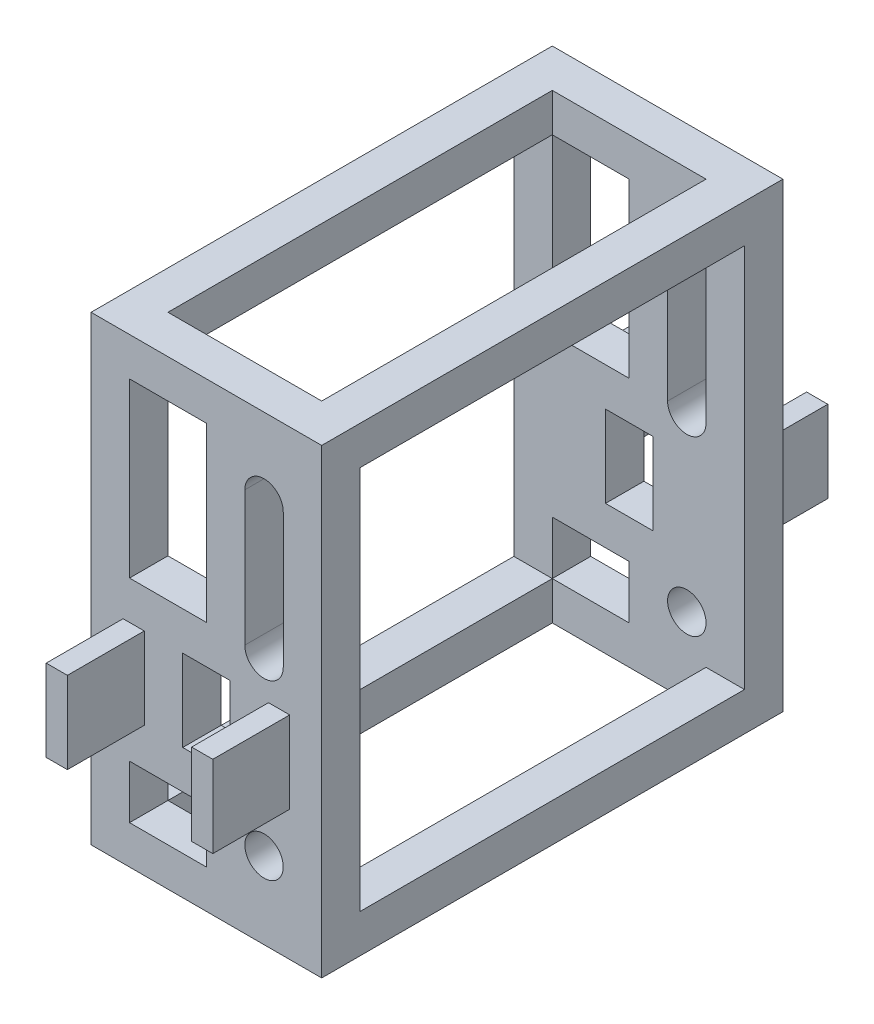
from build123d import *

# Parameters (mm, degrees)
SKETCH1_W           = 76.2
SKETCH1_H           = 152.4
BOSS_EXTRUDE1_DEPTH = 152.4
SKETCH2_W           = 50.8
SKETCH2_H           = 127
CUT_EXTRUDE1_DEPTH  = 229.6
SKETCH4_W           = 127
SKETCH4_H           = 127
CUT_EXTRUDE3_DEPTH  = 229.6
SKETCH5_W           = 7
SKETCH5_H           = 27
BOSS_EXTRUDE2_DEPTH = 25.4
SKETCH6_R           = 6.35
CUT_EXTRUDE4_DEPTH  = 247.262136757
SKETCH7_W           = 25.4
SKETCH7_H           = 57
SKETCH7_H_2         = 17.6
SKETCH7_W_2         = 15.65
SKETCH7_H_3         = 27
CUT_EXTRUDE5_DEPTH  = 247.262136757


with BuildPart() as part:
    # Sketch1 → Boss-Extrude1 (new body)
    with BuildSketch(Plane.XY):
        with Locations((38.1, 76.2)):
            Rectangle(SKETCH1_W, SKETCH1_H)
    extrude(amount=BOSS_EXTRUDE1_DEPTH)

    # Sketch2 → Cut-Extrude1 (cut, through all)
    with BuildSketch(Plane(origin=(0, 152.4, 0), x_dir=(1, 0, 0), z_dir=(0, 1, 0))):
        with Locations((38.1, -76.2)):
            Rectangle(SKETCH2_W, SKETCH2_H)
    extrude(amount=-CUT_EXTRUDE1_DEPTH, mode=Mode.SUBTRACT)

    # Sketch4 → Cut-Extrude3 (cut, through all)
    with BuildSketch(Plane(origin=(76.2, 0, 0), x_dir=(0, 0, -1), z_dir=(1, 0, 0))):
        with Locations((-76.2, 76.2)):
            Rectangle(SKETCH4_W, SKETCH4_H)
    extrude(amount=-CUT_EXTRUDE3_DEPTH, mode=Mode.SUBTRACT)

    # Sketch5 → Boss-Extrude2 (add)
    with BuildSketch(Plane.XY.offset(152.4)):
        with Locations((14.075, 56.5)):
            Rectangle(SKETCH5_W, SKETCH5_H)
        with Locations((62.125, 56.5)):
            Rectangle(SKETCH5_W, SKETCH5_H)
    boss_extrude2 = extrude(amount=BOSS_EXTRUDE2_DEPTH)

    # Mirror1: Boss-Extrude2 across plane
    add(boss_extrude2.mirror(Plane.XY.offset(76.2)))

    # Sketch6 → Cut-Extrude4 (cut, through all)
    with BuildSketch(Plane.XY.offset(152.4)):
        with Locations((57.15, 25.4)):
            Circle(SKETCH6_R)
        with BuildLine():
            Line((50.8, 127), (50.8, 82.55))
            ThreePointArc((50.8, 82.55), (57.15, 76.2), (63.5, 82.55))
            Line((63.5, 82.55), (63.5, 127))
            ThreePointArc((63.5, 127), (57.15, 133.35), (50.8, 127))
        make_face()
    extrude(amount=-CUT_EXTRUDE4_DEPTH, mode=Mode.SUBTRACT)

    # Sketch7 → Cut-Extrude5 (cut, through all)
    with BuildSketch(Plane.XY.offset(152.4)):
        with Locations((25.4, 111.2)):
            Rectangle(SKETCH7_W, SKETCH7_H)
        with Locations((25.4, 21.5)):
            Rectangle(SKETCH7_W, SKETCH7_H_2)
        with Locations((38.1, 56.5)):
            Rectangle(SKETCH7_W_2, SKETCH7_H_3)
    extrude(amount=-CUT_EXTRUDE5_DEPTH, mode=Mode.SUBTRACT)


solid = part.part
